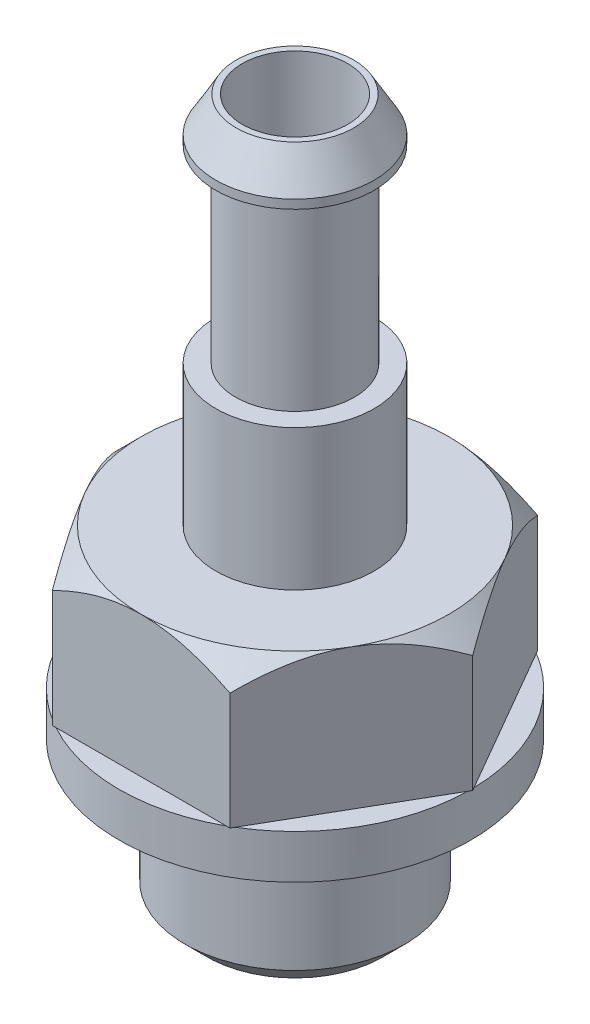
from build123d import *

# Parameters (mm, degrees)
SCHNITT_LINEAR_AUSTRAGEN1_REACH = 15.671
SKIZZE2_R                       = 5


with BuildPart() as part:
    # Skizze1 → Rotation1 (revolve)
    with BuildSketch(Plane.XY, mode=Mode.PRIVATE) as rotation1_sk:
        Polygon((-1.2, 0), (-2, 0), (-2.5, 0.5), (-2.5, 3.3), (-4, 3.3), (-4, 4.3), (-5, 4.3), (-5, 6), (-3.5, 7.5), (-1.8, 7.5), (-1.8, 10.7), (-1.35, 10.7), (-1.35, 15), (-1.8, 15), (-1.8, 15.2), (-1.338119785, 16), (-1.2, 16), align=None)
    revolve(rotation1_sk.sketch.rotate(Axis((0, 0, 0), (0, 1, 0)), 270), axis=Axis((0, 0, 0), (0, 1, 0)))

    # Schnitt-Linear austragen1: up to this cone (the profile starts inside it)
    schnitt_linear_austragen1_end = Plane(origin=(0, 4.3, 0), z_dir=(0, -1, 0)).offset(-6.699999) * Cone(1e-06, 29.571, 29.570999, align=(Align.CENTER, Align.CENTER, Align.MIN), mode=Mode.PRIVATE)
    # Skizze2 → Schnitt-Linear austragen1 (cut, up to the surface)
    with BuildSketch(Plane.XZ.offset(-4.3), mode=Mode.PRIVATE) as schnitt_linear_austragen1_sk1:
        Circle(SKIZZE2_R)
        Polygon((4.041451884, 0), (2.020725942, 3.5), (-2.020725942, 3.5), (-4.041451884, 0), (-2.020725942, -3.5), (2.020725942, -3.5), align=None, mode=Mode.SUBTRACT)
    schnitt_linear_austragen1_tool1 = extrude(schnitt_linear_austragen1_sk1.sketch, amount=-SCHNITT_LINEAR_AUSTRAGEN1_REACH, mode=Mode.PRIVATE) & schnitt_linear_austragen1_end
    add(schnitt_linear_austragen1_tool1.solids().sort_by_distance((-4.858579, 4.3, 0))[0], mode=Mode.SUBTRACT)


solid = part.part
